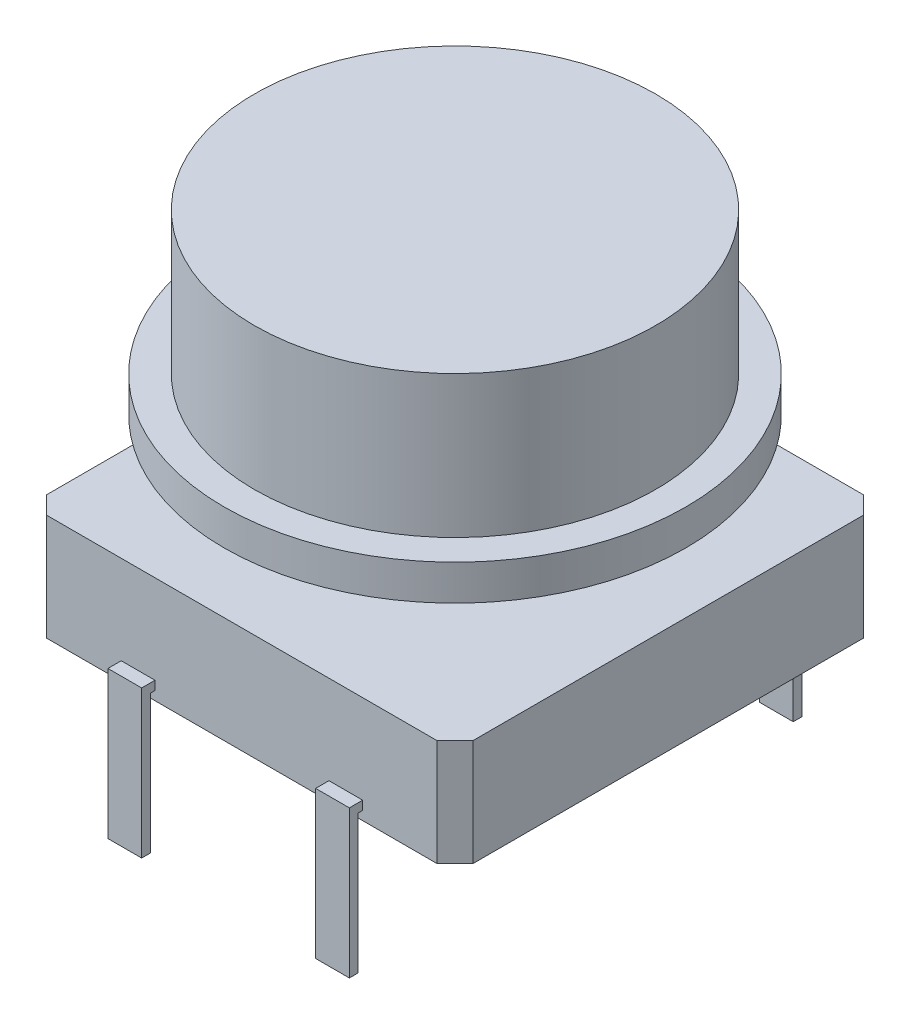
ISO-10303-21;
HEADER;
FILE_DESCRIPTION(('STEP AP214'),'2;1');
FILE_NAME('part.step','',(''),(''),'','','');
FILE_SCHEMA(('AUTOMOTIVE_DESIGN { 1 0 10303 214 1 1 1 1 }'));
ENDSEC;
DATA;
#1=APPLICATION_CONTEXT('core data for automotive mechanical design processes');
#2=APPLICATION_PROTOCOL_DEFINITION('international standard','automotive_design',2000,#1);
#3=PRODUCT_CONTEXT('',#1,'mechanical');
#4=PRODUCT('Part','Part','',(#3));
#5=PRODUCT_RELATED_PRODUCT_CATEGORY('part','',(#4));
#6=PRODUCT_DEFINITION_FORMATION('','',#4);
#7=PRODUCT_DEFINITION_CONTEXT('part definition',#1,'design');
#8=PRODUCT_DEFINITION('design','',#6,#7);
#9=PRODUCT_DEFINITION_SHAPE('','',#8);
#10=(LENGTH_UNIT() NAMED_UNIT(*) SI_UNIT(.MILLI.,.METRE.));
#11=(NAMED_UNIT(*) PLANE_ANGLE_UNIT() SI_UNIT($,.RADIAN.));
#12=(NAMED_UNIT(*) SI_UNIT($,.STERADIAN.) SOLID_ANGLE_UNIT());
#13=UNCERTAINTY_MEASURE_WITH_UNIT(LENGTH_MEASURE(1.E-05),#10,'distance_accuracy_value','');
#14=(GEOMETRIC_REPRESENTATION_CONTEXT(3) GLOBAL_UNCERTAINTY_ASSIGNED_CONTEXT((#13)) GLOBAL_UNIT_ASSIGNED_CONTEXT((#10,
#11,#12)) REPRESENTATION_CONTEXT('',''));
#15=CARTESIAN_POINT('',(0.,0.,0.));
#16=DIRECTION('',(0.,0.,1.));
#17=DIRECTION('',(1.,0.,0.));
#18=AXIS2_PLACEMENT_3D('',#15,#16,#17);
#19=CARTESIAN_POINT('',(-5.5,3.,-6.));
#20=DIRECTION('',(0.,0.,1.));
#21=DIRECTION('',(1.,0.,0.));
#22=AXIS2_PLACEMENT_3D('',#19,#20,#21);
#23=PLANE('',#22);
#24=DIRECTION('',(0.,-1.,0.));
#25=VECTOR('',#24,1.);
#26=CARTESIAN_POINT('',(-2.45,0.5,-6.));
#27=LINE('',#26,#25);
#28=CARTESIAN_POINT('',(-2.45,0.5,-6.));
#29=VERTEX_POINT('',#28);
#30=CARTESIAN_POINT('',(-2.45,0.25,-6.));
#31=VERTEX_POINT('',#30);
#32=EDGE_CURVE('E337',#29,#31,#27,.T.);
#33=ORIENTED_EDGE('',*,*,#32,.F.);
#34=DIRECTION('',(-1.,0.,0.));
#35=VECTOR('',#34,1.);
#36=CARTESIAN_POINT('',(-2.45,0.5,-6.));
#37=LINE('',#36,#35);
#38=CARTESIAN_POINT('',(-3.4,0.5,-6.));
#39=VERTEX_POINT('',#38);
#40=EDGE_CURVE('E362',#29,#39,#37,.T.);
#41=ORIENTED_EDGE('',*,*,#40,.T.);
#42=DIRECTION('',(0.,-1.,0.));
#43=VECTOR('',#42,1.);
#44=CARTESIAN_POINT('',(-3.4,0.5,-6.));
#45=LINE('',#44,#43);
#46=CARTESIAN_POINT('',(-3.4,0.25,-6.));
#47=VERTEX_POINT('',#46);
#48=EDGE_CURVE('E349',#39,#47,#45,.T.);
#49=ORIENTED_EDGE('',*,*,#48,.T.);
#50=DIRECTION('',(-1.,0.,0.));
#51=VECTOR('',#50,1.);
#52=CARTESIAN_POINT('',(-2.45,0.25,-6.));
#53=LINE('',#52,#51);
#54=EDGE_CURVE('E365',#31,#47,#53,.T.);
#55=ORIENTED_EDGE('',*,*,#54,.F.);
#56=EDGE_LOOP('',(#33,#41,#49,#55));
#57=FACE_BOUND('',#56,.T.);
#58=DIRECTION('',(-1.,0.,0.));
#59=VECTOR('',#58,1.);
#60=CARTESIAN_POINT('',(-5.5,0.,-6.));
#61=LINE('',#60,#59);
#62=CARTESIAN_POINT('',(5.5,0.,-6.));
#63=VERTEX_POINT('',#62);
#64=CARTESIAN_POINT('',(-5.5,0.,-6.));
#65=VERTEX_POINT('',#64);
#66=EDGE_CURVE('E547',#63,#65,#61,.T.);
#67=ORIENTED_EDGE('',*,*,#66,.T.);
#68=DIRECTION('',(0.,-1.,0.));
#69=VECTOR('',#68,1.);
#70=CARTESIAN_POINT('',(-5.5,3.,-6.));
#71=LINE('',#70,#69);
#72=CARTESIAN_POINT('',(-5.5,3.,-6.));
#73=VERTEX_POINT('',#72);
#74=EDGE_CURVE('E552',#73,#65,#71,.T.);
#75=ORIENTED_EDGE('',*,*,#74,.F.);
#76=DIRECTION('',(-1.,0.,0.));
#77=VECTOR('',#76,1.);
#78=CARTESIAN_POINT('',(-5.5,3.,-6.));
#79=LINE('',#78,#77);
#80=CARTESIAN_POINT('',(5.5,3.,-6.));
#81=VERTEX_POINT('',#80);
#82=EDGE_CURVE('E530',#81,#73,#79,.T.);
#83=ORIENTED_EDGE('',*,*,#82,.F.);
#84=DIRECTION('',(0.,-1.,0.));
#85=VECTOR('',#84,1.);
#86=CARTESIAN_POINT('',(5.5,3.,-6.));
#87=LINE('',#86,#85);
#88=EDGE_CURVE('E555',#81,#63,#87,.T.);
#89=ORIENTED_EDGE('',*,*,#88,.T.);
#90=EDGE_LOOP('',(#67,#75,#83,#89));
#91=FACE_BOUND('',#90,.T.);
#92=DIRECTION('',(0.,-1.,0.));
#93=VECTOR('',#92,1.);
#94=CARTESIAN_POINT('',(2.45,0.5,-6.));
#95=LINE('',#94,#93);
#96=CARTESIAN_POINT('',(2.45,0.5,-6.));
#97=VERTEX_POINT('',#96);
#98=CARTESIAN_POINT('',(2.45,0.25,-6.));
#99=VERTEX_POINT('',#98);
#100=EDGE_CURVE('E304',#97,#99,#95,.T.);
#101=ORIENTED_EDGE('',*,*,#100,.T.);
#102=DIRECTION('',(1.,0.,0.));
#103=VECTOR('',#102,1.);
#104=CARTESIAN_POINT('',(2.45,0.25,-6.));
#105=LINE('',#104,#103);
#106=CARTESIAN_POINT('',(3.4,0.25,-6.));
#107=VERTEX_POINT('',#106);
#108=EDGE_CURVE('E323',#99,#107,#105,.T.);
#109=ORIENTED_EDGE('',*,*,#108,.T.);
#110=DIRECTION('',(0.,-1.,0.));
#111=VECTOR('',#110,1.);
#112=CARTESIAN_POINT('',(3.4,0.5,-6.));
#113=LINE('',#112,#111);
#114=CARTESIAN_POINT('',(3.4,0.5,-6.));
#115=VERTEX_POINT('',#114);
#116=EDGE_CURVE('E315',#115,#107,#113,.T.);
#117=ORIENTED_EDGE('',*,*,#116,.F.);
#118=DIRECTION('',(1.,0.,0.));
#119=VECTOR('',#118,1.);
#120=CARTESIAN_POINT('',(2.45,0.5,-6.));
#121=LINE('',#120,#119);
#122=EDGE_CURVE('E326',#97,#115,#121,.T.);
#123=ORIENTED_EDGE('',*,*,#122,.F.);
#124=EDGE_LOOP('',(#101,#109,#117,#123));
#125=FACE_BOUND('',#124,.T.);
#126=ADVANCED_FACE('F35',(#57,#91,#125),#23,.F.);
#127=CARTESIAN_POINT('',(-5.5,3.,6.));
#128=DIRECTION('',(0.,0.,-1.));
#129=DIRECTION('',(-1.,0.,0.));
#130=AXIS2_PLACEMENT_3D('',#127,#128,#129);
#131=PLANE('',#130);
#132=DIRECTION('',(0.,-1.,0.));
#133=VECTOR('',#132,1.);
#134=CARTESIAN_POINT('',(-2.45,0.5,6.));
#135=LINE('',#134,#133);
#136=CARTESIAN_POINT('',(-2.45,0.5,6.));
#137=VERTEX_POINT('',#136);
#138=CARTESIAN_POINT('',(-2.45,0.25,6.));
#139=VERTEX_POINT('',#138);
#140=EDGE_CURVE('E427',#137,#139,#135,.T.);
#141=ORIENTED_EDGE('',*,*,#140,.T.);
#142=DIRECTION('',(-1.,0.,0.));
#143=VECTOR('',#142,1.);
#144=CARTESIAN_POINT('',(-2.45,0.25,6.));
#145=LINE('',#144,#143);
#146=CARTESIAN_POINT('',(-3.4,0.25,6.));
#147=VERTEX_POINT('',#146);
#148=EDGE_CURVE('E457',#139,#147,#145,.T.);
#149=ORIENTED_EDGE('',*,*,#148,.T.);
#150=DIRECTION('',(0.,-1.,0.));
#151=VECTOR('',#150,1.);
#152=CARTESIAN_POINT('',(-3.4,0.5,6.));
#153=LINE('',#152,#151);
#154=CARTESIAN_POINT('',(-3.4,0.5,6.));
#155=VERTEX_POINT('',#154);
#156=EDGE_CURVE('E444',#155,#147,#153,.T.);
#157=ORIENTED_EDGE('',*,*,#156,.F.);
#158=DIRECTION('',(-1.,0.,0.));
#159=VECTOR('',#158,1.);
#160=CARTESIAN_POINT('',(-2.45,0.5,6.));
#161=LINE('',#160,#159);
#162=EDGE_CURVE('E460',#137,#155,#161,.T.);
#163=ORIENTED_EDGE('',*,*,#162,.F.);
#164=EDGE_LOOP('',(#141,#149,#157,#163));
#165=FACE_BOUND('',#164,.T.);
#166=DIRECTION('',(1.,0.,0.));
#167=VECTOR('',#166,1.);
#168=CARTESIAN_POINT('',(-5.5,0.,6.));
#169=LINE('',#168,#167);
#170=CARTESIAN_POINT('',(-5.5,0.,6.));
#171=VERTEX_POINT('',#170);
#172=CARTESIAN_POINT('',(5.5,0.,6.));
#173=VERTEX_POINT('',#172);
#174=EDGE_CURVE('E539',#171,#173,#169,.T.);
#175=ORIENTED_EDGE('',*,*,#174,.T.);
#176=DIRECTION('',(0.,-1.,0.));
#177=VECTOR('',#176,1.);
#178=CARTESIAN_POINT('',(5.5,3.,6.));
#179=LINE('',#178,#177);
#180=CARTESIAN_POINT('',(5.5,3.,6.));
#181=VERTEX_POINT('',#180);
#182=EDGE_CURVE('E564',#181,#173,#179,.T.);
#183=ORIENTED_EDGE('',*,*,#182,.F.);
#184=DIRECTION('',(1.,0.,0.));
#185=VECTOR('',#184,1.);
#186=CARTESIAN_POINT('',(-5.5,3.,6.));
#187=LINE('',#186,#185);
#188=CARTESIAN_POINT('',(-5.5,3.,6.));
#189=VERTEX_POINT('',#188);
#190=EDGE_CURVE('E522',#189,#181,#187,.T.);
#191=ORIENTED_EDGE('',*,*,#190,.F.);
#192=DIRECTION('',(0.,-1.,0.));
#193=VECTOR('',#192,1.);
#194=CARTESIAN_POINT('',(-5.5,3.,6.));
#195=LINE('',#194,#193);
#196=EDGE_CURVE('E566',#189,#171,#195,.T.);
#197=ORIENTED_EDGE('',*,*,#196,.T.);
#198=EDGE_LOOP('',(#175,#183,#191,#197));
#199=FACE_BOUND('',#198,.T.);
#200=DIRECTION('',(0.,-1.,0.));
#201=VECTOR('',#200,1.);
#202=CARTESIAN_POINT('',(2.45,0.5,6.));
#203=LINE('',#202,#201);
#204=CARTESIAN_POINT('',(2.45,0.5,6.));
#205=VERTEX_POINT('',#204);
#206=CARTESIAN_POINT('',(2.45,0.25,6.));
#207=VERTEX_POINT('',#206);
#208=EDGE_CURVE('E380',#205,#207,#203,.T.);
#209=ORIENTED_EDGE('',*,*,#208,.F.);
#210=DIRECTION('',(1.,0.,0.));
#211=VECTOR('',#210,1.);
#212=CARTESIAN_POINT('',(2.45,0.5,6.));
#213=LINE('',#212,#211);
#214=CARTESIAN_POINT('',(3.4,0.5,6.));
#215=VERTEX_POINT('',#214);
#216=EDGE_CURVE('E406',#205,#215,#213,.T.);
#217=ORIENTED_EDGE('',*,*,#216,.T.);
#218=DIRECTION('',(0.,-1.,0.));
#219=VECTOR('',#218,1.);
#220=CARTESIAN_POINT('',(3.4,0.5,6.));
#221=LINE('',#220,#219);
#222=CARTESIAN_POINT('',(3.4,0.25,6.));
#223=VERTEX_POINT('',#222);
#224=EDGE_CURVE('E393',#215,#223,#221,.T.);
#225=ORIENTED_EDGE('',*,*,#224,.T.);
#226=DIRECTION('',(1.,0.,0.));
#227=VECTOR('',#226,1.);
#228=CARTESIAN_POINT('',(2.45,0.25,6.));
#229=LINE('',#228,#227);
#230=EDGE_CURVE('E409',#207,#223,#229,.T.);
#231=ORIENTED_EDGE('',*,*,#230,.F.);
#232=EDGE_LOOP('',(#209,#217,#225,#231));
#233=FACE_BOUND('',#232,.T.);
#234=ADVANCED_FACE('F587',(#165,#199,#233),#131,.F.);
#235=CARTESIAN_POINT('',(-6.,3.,-5.5));
#236=DIRECTION('',(1.,0.,0.));
#237=DIRECTION('',(0.,0.,-1.));
#238=AXIS2_PLACEMENT_3D('',#235,#236,#237);
#239=PLANE('',#238);
#240=DIRECTION('',(0.,0.,1.));
#241=VECTOR('',#240,1.);
#242=CARTESIAN_POINT('',(-6.,0.,-5.5));
#243=LINE('',#242,#241);
#244=CARTESIAN_POINT('',(-6.,0.,-5.5));
#245=VERTEX_POINT('',#244);
#246=CARTESIAN_POINT('',(-6.,0.,5.5));
#247=VERTEX_POINT('',#246);
#248=EDGE_CURVE('E513',#245,#247,#243,.T.);
#249=ORIENTED_EDGE('',*,*,#248,.T.);
#250=DIRECTION('',(0.,-1.,0.));
#251=VECTOR('',#250,1.);
#252=CARTESIAN_POINT('',(-6.,3.,5.5));
#253=LINE('',#252,#251);
#254=CARTESIAN_POINT('',(-6.,3.,5.5));
#255=VERTEX_POINT('',#254);
#256=EDGE_CURVE('E39',#255,#247,#253,.T.);
#257=ORIENTED_EDGE('',*,*,#256,.F.);
#258=DIRECTION('',(0.,0.,1.));
#259=VECTOR('',#258,1.);
#260=CARTESIAN_POINT('',(-6.,3.,-5.5));
#261=LINE('',#260,#259);
#262=CARTESIAN_POINT('',(-6.,3.,-5.5));
#263=VERTEX_POINT('',#262);
#264=EDGE_CURVE('E516',#263,#255,#261,.T.);
#265=ORIENTED_EDGE('',*,*,#264,.F.);
#266=DIRECTION('',(0.,-1.,0.));
#267=VECTOR('',#266,1.);
#268=CARTESIAN_POINT('',(-6.,3.,-5.5));
#269=LINE('',#268,#267);
#270=EDGE_CURVE('E534',#263,#245,#269,.T.);
#271=ORIENTED_EDGE('',*,*,#270,.T.);
#272=EDGE_LOOP('',(#249,#257,#265,#271));
#273=FACE_BOUND('',#272,.T.);
#274=ADVANCED_FACE('F37',(#273),#239,.F.);
#275=CARTESIAN_POINT('',(-6.,3.,5.5));
#276=DIRECTION('',(0.707106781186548,0.,-0.707106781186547));
#277=DIRECTION('',(-0.707106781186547,0.,-0.707106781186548));
#278=AXIS2_PLACEMENT_3D('',#275,#276,#277);
#279=PLANE('',#278);
#280=DIRECTION('',(0.707106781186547,0.,0.707106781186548));
#281=VECTOR('',#280,1.);
#282=CARTESIAN_POINT('',(-6.,0.,5.5));
#283=LINE('',#282,#281);
#284=EDGE_CURVE('E537',#247,#171,#283,.T.);
#285=ORIENTED_EDGE('',*,*,#284,.T.);
#286=ORIENTED_EDGE('',*,*,#196,.F.);
#287=DIRECTION('',(0.707106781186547,0.,0.707106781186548));
#288=VECTOR('',#287,1.);
#289=CARTESIAN_POINT('',(-6.,3.,5.5));
#290=LINE('',#289,#288);
#291=EDGE_CURVE('E519',#255,#189,#290,.T.);
#292=ORIENTED_EDGE('',*,*,#291,.F.);
#293=ORIENTED_EDGE('',*,*,#256,.T.);
#294=EDGE_LOOP('',(#285,#286,#292,#293));
#295=FACE_BOUND('',#294,.T.);
#296=ADVANCED_FACE('F575',(#295),#279,.F.);
#297=CARTESIAN_POINT('',(5.5,3.,6.));
#298=DIRECTION('',(-0.707106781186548,0.,-0.707106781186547));
#299=DIRECTION('',(-0.707106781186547,0.,0.707106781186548));
#300=AXIS2_PLACEMENT_3D('',#297,#298,#299);
#301=PLANE('',#300);
#302=DIRECTION('',(0.707106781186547,0.,-0.707106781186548));
#303=VECTOR('',#302,1.);
#304=CARTESIAN_POINT('',(5.5,0.,6.));
#305=LINE('',#304,#303);
#306=CARTESIAN_POINT('',(6.,0.,5.5));
#307=VERTEX_POINT('',#306);
#308=EDGE_CURVE('E541',#173,#307,#305,.T.);
#309=ORIENTED_EDGE('',*,*,#308,.T.);
#310=DIRECTION('',(0.,-1.,0.));
#311=VECTOR('',#310,1.);
#312=CARTESIAN_POINT('',(6.,3.,5.5));
#313=LINE('',#312,#311);
#314=CARTESIAN_POINT('',(6.,3.,5.5));
#315=VERTEX_POINT('',#314);
#316=EDGE_CURVE('E561',#315,#307,#313,.T.);
#317=ORIENTED_EDGE('',*,*,#316,.F.);
#318=DIRECTION('',(0.707106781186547,0.,-0.707106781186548));
#319=VECTOR('',#318,1.);
#320=CARTESIAN_POINT('',(5.5,3.,6.));
#321=LINE('',#320,#319);
#322=EDGE_CURVE('E524',#181,#315,#321,.T.);
#323=ORIENTED_EDGE('',*,*,#322,.F.);
#324=ORIENTED_EDGE('',*,*,#182,.T.);
#325=EDGE_LOOP('',(#309,#317,#323,#324));
#326=FACE_BOUND('',#325,.T.);
#327=ADVANCED_FACE('F591',(#326),#301,.F.);
#328=CARTESIAN_POINT('',(6.,3.,-5.5));
#329=DIRECTION('',(-1.,0.,0.));
#330=DIRECTION('',(0.,0.,1.));
#331=AXIS2_PLACEMENT_3D('',#328,#329,#330);
#332=PLANE('',#331);
#333=DIRECTION('',(0.,0.,-1.));
#334=VECTOR('',#333,1.);
#335=CARTESIAN_POINT('',(6.,0.,-5.5));
#336=LINE('',#335,#334);
#337=CARTESIAN_POINT('',(6.,0.,-5.5));
#338=VERTEX_POINT('',#337);
#339=EDGE_CURVE('E543',#307,#338,#336,.T.);
#340=ORIENTED_EDGE('',*,*,#339,.T.);
#341=DIRECTION('',(0.,-1.,0.));
#342=VECTOR('',#341,1.);
#343=CARTESIAN_POINT('',(6.,3.,-5.5));
#344=LINE('',#343,#342);
#345=CARTESIAN_POINT('',(6.,3.,-5.5));
#346=VERTEX_POINT('',#345);
#347=EDGE_CURVE('E558',#346,#338,#344,.T.);
#348=ORIENTED_EDGE('',*,*,#347,.F.);
#349=DIRECTION('',(0.,0.,-1.));
#350=VECTOR('',#349,1.);
#351=CARTESIAN_POINT('',(6.,3.,-5.5));
#352=LINE('',#351,#350);
#353=EDGE_CURVE('E526',#315,#346,#352,.T.);
#354=ORIENTED_EDGE('',*,*,#353,.F.);
#355=ORIENTED_EDGE('',*,*,#316,.T.);
#356=EDGE_LOOP('',(#340,#348,#354,#355));
#357=FACE_BOUND('',#356,.T.);
#358=ADVANCED_FACE('F610',(#357),#332,.F.);
#359=CARTESIAN_POINT('',(5.5,3.,-6.));
#360=DIRECTION('',(-0.707106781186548,0.,0.707106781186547));
#361=DIRECTION('',(0.707106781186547,0.,0.707106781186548));
#362=AXIS2_PLACEMENT_3D('',#359,#360,#361);
#363=PLANE('',#362);
#364=DIRECTION('',(-0.707106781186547,0.,-0.707106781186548));
#365=VECTOR('',#364,1.);
#366=CARTESIAN_POINT('',(5.5,0.,-6.));
#367=LINE('',#366,#365);
#368=EDGE_CURVE('E545',#338,#63,#367,.T.);
#369=ORIENTED_EDGE('',*,*,#368,.T.);
#370=ORIENTED_EDGE('',*,*,#88,.F.);
#371=DIRECTION('',(-0.707106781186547,0.,-0.707106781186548));
#372=VECTOR('',#371,1.);
#373=CARTESIAN_POINT('',(5.5,3.,-6.));
#374=LINE('',#373,#372);
#375=EDGE_CURVE('E528',#346,#81,#374,.T.);
#376=ORIENTED_EDGE('',*,*,#375,.F.);
#377=ORIENTED_EDGE('',*,*,#347,.T.);
#378=EDGE_LOOP('',(#369,#370,#376,#377));
#379=FACE_BOUND('',#378,.T.);
#380=ADVANCED_FACE('F607',(#379),#363,.F.);
#381=CARTESIAN_POINT('',(-5.5,3.,-6.));
#382=DIRECTION('',(0.707106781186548,0.,0.707106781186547));
#383=DIRECTION('',(0.707106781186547,0.,-0.707106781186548));
#384=AXIS2_PLACEMENT_3D('',#381,#382,#383);
#385=PLANE('',#384);
#386=DIRECTION('',(-0.707106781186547,0.,0.707106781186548));
#387=VECTOR('',#386,1.);
#388=CARTESIAN_POINT('',(-5.5,0.,-6.));
#389=LINE('',#388,#387);
#390=EDGE_CURVE('E520',#65,#245,#389,.T.);
#391=ORIENTED_EDGE('',*,*,#390,.T.);
#392=ORIENTED_EDGE('',*,*,#270,.F.);
#393=DIRECTION('',(-0.707106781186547,0.,0.707106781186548));
#394=VECTOR('',#393,1.);
#395=CARTESIAN_POINT('',(-5.5,3.,-6.));
#396=LINE('',#395,#394);
#397=EDGE_CURVE('E532',#73,#263,#396,.T.);
#398=ORIENTED_EDGE('',*,*,#397,.F.);
#399=ORIENTED_EDGE('',*,*,#74,.T.);
#400=EDGE_LOOP('',(#391,#392,#398,#399));
#401=FACE_BOUND('',#400,.T.);
#402=ADVANCED_FACE('F601',(#401),#385,.F.);
#403=CARTESIAN_POINT('',(0.,3.,0.));
#404=DIRECTION('',(0.,1.,0.));
#405=DIRECTION('',(0.,0.,1.));
#406=AXIS2_PLACEMENT_3D('',#403,#404,#405);
#407=PLANE('',#406);
#408=CARTESIAN_POINT('',(0.,3.,0.));
#409=DIRECTION('',(0.,1.,0.));
#410=DIRECTION('',(0.,0.,1.));
#411=AXIS2_PLACEMENT_3D('',#408,#409,#410);
#412=CIRCLE('',#411,3.375);
#413=CARTESIAN_POINT('',(0.,3.,3.375));
#414=VERTEX_POINT('',#413);
#415=EDGE_CURVE('E44',#414,#414,#412,.T.);
#416=ORIENTED_EDGE('',*,*,#415,.F.);
#417=EDGE_LOOP('',(#416));
#418=FACE_BOUND('',#417,.T.);
#419=ORIENTED_EDGE('',*,*,#264,.T.);
#420=ORIENTED_EDGE('',*,*,#291,.T.);
#421=ORIENTED_EDGE('',*,*,#190,.T.);
#422=ORIENTED_EDGE('',*,*,#322,.T.);
#423=ORIENTED_EDGE('',*,*,#353,.T.);
#424=ORIENTED_EDGE('',*,*,#375,.T.);
#425=ORIENTED_EDGE('',*,*,#82,.T.);
#426=ORIENTED_EDGE('',*,*,#397,.T.);
#427=EDGE_LOOP('',(#419,#420,#421,#422,#423,#424,#425,#426));
#428=FACE_BOUND('',#427,.T.);
#429=ADVANCED_FACE('F595',(#418,#428),#407,.T.);
#430=CARTESIAN_POINT('',(0.,0.,0.));
#431=DIRECTION('',(0.,1.,0.));
#432=DIRECTION('',(0.,0.,1.));
#433=AXIS2_PLACEMENT_3D('',#430,#431,#432);
#434=PLANE('',#433);
#435=ORIENTED_EDGE('',*,*,#248,.F.);
#436=ORIENTED_EDGE('',*,*,#390,.F.);
#437=ORIENTED_EDGE('',*,*,#66,.F.);
#438=ORIENTED_EDGE('',*,*,#368,.F.);
#439=ORIENTED_EDGE('',*,*,#339,.F.);
#440=ORIENTED_EDGE('',*,*,#308,.F.);
#441=ORIENTED_EDGE('',*,*,#174,.F.);
#442=ORIENTED_EDGE('',*,*,#284,.F.);
#443=EDGE_LOOP('',(#435,#436,#437,#438,#439,#440,#441,#442));
#444=FACE_BOUND('',#443,.T.);
#445=ADVANCED_FACE('F582',(#444),#434,.F.);
#446=CARTESIAN_POINT('',(0.,3.2,0.));
#447=DIRECTION('',(0.,-1.,0.));
#448=DIRECTION('',(0.,0.,-1.));
#449=AXIS2_PLACEMENT_3D('',#446,#447,#448);
#450=CYLINDRICAL_SURFACE('',#449,3.375);
#451=CARTESIAN_POINT('',(0.,3.2,0.));
#452=DIRECTION('',(0.,1.,0.));
#453=DIRECTION('',(0.,0.,1.));
#454=AXIS2_PLACEMENT_3D('',#451,#452,#453);
#455=CIRCLE('',#454,3.375);
#456=CARTESIAN_POINT('',(0.,3.2,3.375));
#457=VERTEX_POINT('',#456);
#458=EDGE_CURVE('E510',#457,#457,#455,.T.);
#459=ORIENTED_EDGE('',*,*,#458,.F.);
#460=EDGE_LOOP('',(#459));
#461=FACE_BOUND('',#460,.T.);
#462=ORIENTED_EDGE('',*,*,#415,.T.);
#463=EDGE_LOOP('',(#462));
#464=FACE_BOUND('',#463,.T.);
#465=ADVANCED_FACE('F633',(#461,#464),#450,.T.);
#466=CARTESIAN_POINT('',(0.,3.2,0.));
#467=DIRECTION('',(0.,1.,0.));
#468=DIRECTION('',(0.,0.,1.));
#469=AXIS2_PLACEMENT_3D('',#466,#467,#468);
#470=PLANE('',#469);
#471=DIRECTION('',(0.,0.,-1.));
#472=VECTOR('',#471,1.);
#473=CARTESIAN_POINT('',(1.75,3.2,-1.75));
#474=LINE('',#473,#472);
#475=CARTESIAN_POINT('',(1.75,3.2,1.75));
#476=VERTEX_POINT('',#475);
#477=CARTESIAN_POINT('',(1.75,3.2,-1.75));
#478=VERTEX_POINT('',#477);
#479=EDGE_CURVE('E472',#476,#478,#474,.T.);
#480=ORIENTED_EDGE('',*,*,#479,.F.);
#481=DIRECTION('',(1.,0.,0.));
#482=VECTOR('',#481,1.);
#483=CARTESIAN_POINT('',(-1.75,3.2,1.75));
#484=LINE('',#483,#482);
#485=CARTESIAN_POINT('',(-1.75,3.2,1.75));
#486=VERTEX_POINT('',#485);
#487=EDGE_CURVE('E479',#486,#476,#484,.T.);
#488=ORIENTED_EDGE('',*,*,#487,.F.);
#489=DIRECTION('',(0.,0.,1.));
#490=VECTOR('',#489,1.);
#491=CARTESIAN_POINT('',(-1.75,3.2,-1.75));
#492=LINE('',#491,#490);
#493=CARTESIAN_POINT('',(-1.75,3.2,-1.75));
#494=VERTEX_POINT('',#493);
#495=EDGE_CURVE('E494',#494,#486,#492,.T.);
#496=ORIENTED_EDGE('',*,*,#495,.F.);
#497=DIRECTION('',(-1.,0.,0.));
#498=VECTOR('',#497,1.);
#499=CARTESIAN_POINT('',(-1.75,3.2,-1.75));
#500=LINE('',#499,#498);
#501=EDGE_CURVE('E491',#478,#494,#500,.T.);
#502=ORIENTED_EDGE('',*,*,#501,.F.);
#503=EDGE_LOOP('',(#480,#488,#496,#502));
#504=FACE_BOUND('',#503,.T.);
#505=ORIENTED_EDGE('',*,*,#458,.T.);
#506=EDGE_LOOP('',(#505));
#507=FACE_BOUND('',#506,.T.);
#508=ADVANCED_FACE('F639',(#504,#507),#470,.T.);
#509=CARTESIAN_POINT('',(1.75,5.2,-1.75));
#510=DIRECTION('',(-1.,0.,0.));
#511=DIRECTION('',(0.,0.,1.));
#512=AXIS2_PLACEMENT_3D('',#509,#510,#511);
#513=PLANE('',#512);
#514=ORIENTED_EDGE('',*,*,#479,.T.);
#515=DIRECTION('',(0.,-1.,0.));
#516=VECTOR('',#515,1.);
#517=CARTESIAN_POINT('',(1.75,5.2,-1.75));
#518=LINE('',#517,#516);
#519=CARTESIAN_POINT('',(1.75,5.2,-1.75));
#520=VERTEX_POINT('',#519);
#521=EDGE_CURVE('E507',#520,#478,#518,.T.);
#522=ORIENTED_EDGE('',*,*,#521,.F.);
#523=DIRECTION('',(0.,0.,-1.));
#524=VECTOR('',#523,1.);
#525=CARTESIAN_POINT('',(1.75,5.2,-1.75));
#526=LINE('',#525,#524);
#527=CARTESIAN_POINT('',(1.75,5.2,1.75));
#528=VERTEX_POINT('',#527);
#529=EDGE_CURVE('E475',#528,#520,#526,.T.);
#530=ORIENTED_EDGE('',*,*,#529,.F.);
#531=DIRECTION('',(0.,-1.,0.));
#532=VECTOR('',#531,1.);
#533=CARTESIAN_POINT('',(1.75,5.2,1.75));
#534=LINE('',#533,#532);
#535=EDGE_CURVE('E488',#528,#476,#534,.T.);
#536=ORIENTED_EDGE('',*,*,#535,.T.);
#537=EDGE_LOOP('',(#514,#522,#530,#536));
#538=FACE_BOUND('',#537,.T.);
#539=ADVANCED_FACE('F643',(#538),#513,.F.);
#540=CARTESIAN_POINT('',(-1.75,5.2,-1.75));
#541=DIRECTION('',(0.,0.,1.));
#542=DIRECTION('',(1.,0.,0.));
#543=AXIS2_PLACEMENT_3D('',#540,#541,#542);
#544=PLANE('',#543);
#545=ORIENTED_EDGE('',*,*,#501,.T.);
#546=DIRECTION('',(0.,-1.,0.));
#547=VECTOR('',#546,1.);
#548=CARTESIAN_POINT('',(-1.75,5.2,-1.75));
#549=LINE('',#548,#547);
#550=CARTESIAN_POINT('',(-1.75,5.2,-1.75));
#551=VERTEX_POINT('',#550);
#552=EDGE_CURVE('E504',#551,#494,#549,.T.);
#553=ORIENTED_EDGE('',*,*,#552,.F.);
#554=DIRECTION('',(-1.,0.,0.));
#555=VECTOR('',#554,1.);
#556=CARTESIAN_POINT('',(-1.75,5.2,-1.75));
#557=LINE('',#556,#555);
#558=EDGE_CURVE('E478',#520,#551,#557,.T.);
#559=ORIENTED_EDGE('',*,*,#558,.F.);
#560=ORIENTED_EDGE('',*,*,#521,.T.);
#561=EDGE_LOOP('',(#545,#553,#559,#560));
#562=FACE_BOUND('',#561,.T.);
#563=ADVANCED_FACE('F647',(#562),#544,.F.);
#564=CARTESIAN_POINT('',(-1.75,5.2,-1.75));
#565=DIRECTION('',(1.,0.,0.));
#566=DIRECTION('',(0.,0.,-1.));
#567=AXIS2_PLACEMENT_3D('',#564,#565,#566);
#568=PLANE('',#567);
#569=ORIENTED_EDGE('',*,*,#495,.T.);
#570=DIRECTION('',(0.,-1.,0.));
#571=VECTOR('',#570,1.);
#572=CARTESIAN_POINT('',(-1.75,5.2,1.75));
#573=LINE('',#572,#571);
#574=CARTESIAN_POINT('',(-1.75,5.2,1.75));
#575=VERTEX_POINT('',#574);
#576=EDGE_CURVE('E501',#575,#486,#573,.T.);
#577=ORIENTED_EDGE('',*,*,#576,.F.);
#578=DIRECTION('',(0.,0.,1.));
#579=VECTOR('',#578,1.);
#580=CARTESIAN_POINT('',(-1.75,5.2,-1.75));
#581=LINE('',#580,#579);
#582=EDGE_CURVE('E482',#551,#575,#581,.T.);
#583=ORIENTED_EDGE('',*,*,#582,.F.);
#584=ORIENTED_EDGE('',*,*,#552,.T.);
#585=EDGE_LOOP('',(#569,#577,#583,#584));
#586=FACE_BOUND('',#585,.T.);
#587=ADVANCED_FACE('F651',(#586),#568,.F.);
#588=CARTESIAN_POINT('',(-1.75,5.2,1.75));
#589=DIRECTION('',(0.,0.,-1.));
#590=DIRECTION('',(-1.,0.,0.));
#591=AXIS2_PLACEMENT_3D('',#588,#589,#590);
#592=PLANE('',#591);
#593=ORIENTED_EDGE('',*,*,#487,.T.);
#594=ORIENTED_EDGE('',*,*,#535,.F.);
#595=DIRECTION('',(1.,0.,0.));
#596=VECTOR('',#595,1.);
#597=CARTESIAN_POINT('',(-1.75,5.2,1.75));
#598=LINE('',#597,#596);
#599=EDGE_CURVE('E485',#575,#528,#598,.T.);
#600=ORIENTED_EDGE('',*,*,#599,.F.);
#601=ORIENTED_EDGE('',*,*,#576,.T.);
#602=EDGE_LOOP('',(#593,#594,#600,#601));
#603=FACE_BOUND('',#602,.T.);
#604=ADVANCED_FACE('F655',(#603),#592,.F.);
#605=CARTESIAN_POINT('',(0.,5.2,0.));
#606=DIRECTION('',(0.,1.,0.));
#607=DIRECTION('',(0.,0.,1.));
#608=AXIS2_PLACEMENT_3D('',#605,#606,#607);
#609=PLANE('',#608);
#610=CARTESIAN_POINT('',(0.,5.2,0.));
#611=DIRECTION('',(0.,1.,0.));
#612=DIRECTION('',(0.,0.,1.));
#613=AXIS2_PLACEMENT_3D('',#610,#611,#612);
#614=CIRCLE('',#613,6.5);
#615=CARTESIAN_POINT('',(0.,5.2,6.5));
#616=VERTEX_POINT('',#615);
#617=EDGE_CURVE('E467',#616,#616,#614,.T.);
#618=ORIENTED_EDGE('',*,*,#617,.F.);
#619=EDGE_LOOP('',(#618));
#620=FACE_BOUND('',#619,.T.);
#621=ORIENTED_EDGE('',*,*,#599,.T.);
#622=ORIENTED_EDGE('',*,*,#529,.T.);
#623=ORIENTED_EDGE('',*,*,#558,.T.);
#624=ORIENTED_EDGE('',*,*,#582,.T.);
#625=EDGE_LOOP('',(#621,#622,#623,#624));
#626=FACE_BOUND('',#625,.T.);
#627=ADVANCED_FACE('F659',(#620,#626),#609,.F.);
#628=CARTESIAN_POINT('',(0.,6.2,0.));
#629=DIRECTION('',(0.,-1.,0.));
#630=DIRECTION('',(0.,0.,-1.));
#631=AXIS2_PLACEMENT_3D('',#628,#629,#630);
#632=CYLINDRICAL_SURFACE('',#631,6.5);
#633=CARTESIAN_POINT('',(0.,6.2,0.));
#634=DIRECTION('',(0.,1.,0.));
#635=DIRECTION('',(0.,0.,1.));
#636=AXIS2_PLACEMENT_3D('',#633,#634,#635);
#637=CIRCLE('',#636,6.5);
#638=CARTESIAN_POINT('',(0.,6.2,6.5));
#639=VERTEX_POINT('',#638);
#640=EDGE_CURVE('E469',#639,#639,#637,.T.);
#641=ORIENTED_EDGE('',*,*,#640,.F.);
#642=EDGE_LOOP('',(#641));
#643=FACE_BOUND('',#642,.T.);
#644=ORIENTED_EDGE('',*,*,#617,.T.);
#645=EDGE_LOOP('',(#644));
#646=FACE_BOUND('',#645,.T.);
#647=ADVANCED_FACE('F661',(#643,#646),#632,.T.);
#648=CARTESIAN_POINT('',(0.,6.2,0.));
#649=DIRECTION('',(0.,1.,0.));
#650=DIRECTION('',(0.,0.,1.));
#651=AXIS2_PLACEMENT_3D('',#648,#649,#650);
#652=PLANE('',#651);
#653=CARTESIAN_POINT('',(0.,6.2,0.));
#654=DIRECTION('',(0.,1.,0.));
#655=DIRECTION('',(0.,0.,1.));
#656=AXIS2_PLACEMENT_3D('',#653,#654,#655);
#657=CIRCLE('',#656,5.65);
#658=CARTESIAN_POINT('',(0.,6.2,5.65));
#659=VERTEX_POINT('',#658);
#660=EDGE_CURVE('E11',#659,#659,#657,.T.);
#661=ORIENTED_EDGE('',*,*,#660,.F.);
#662=EDGE_LOOP('',(#661));
#663=FACE_BOUND('',#662,.T.);
#664=ORIENTED_EDGE('',*,*,#640,.T.);
#665=EDGE_LOOP('',(#664));
#666=FACE_BOUND('',#665,.T.);
#667=ADVANCED_FACE('F664',(#663,#666),#652,.T.);
#668=CARTESIAN_POINT('',(0.,10.2,0.));
#669=DIRECTION('',(0.,-1.,0.));
#670=DIRECTION('',(0.,0.,-1.));
#671=AXIS2_PLACEMENT_3D('',#668,#669,#670);
#672=CYLINDRICAL_SURFACE('',#671,5.65);
#673=CARTESIAN_POINT('',(0.,10.2,0.));
#674=DIRECTION('',(0.,1.,0.));
#675=DIRECTION('',(0.,0.,1.));
#676=AXIS2_PLACEMENT_3D('',#673,#674,#675);
#677=CIRCLE('',#676,5.65);
#678=CARTESIAN_POINT('',(0.,10.2,5.65));
#679=VERTEX_POINT('',#678);
#680=EDGE_CURVE('E454',#679,#679,#677,.T.);
#681=ORIENTED_EDGE('',*,*,#680,.F.);
#682=EDGE_LOOP('',(#681));
#683=FACE_BOUND('',#682,.T.);
#684=ORIENTED_EDGE('',*,*,#660,.T.);
#685=EDGE_LOOP('',(#684));
#686=FACE_BOUND('',#685,.T.);
#687=ADVANCED_FACE('F671',(#683,#686),#672,.T.);
#688=CARTESIAN_POINT('',(0.,10.2,0.));
#689=DIRECTION('',(0.,1.,0.));
#690=DIRECTION('',(0.,0.,1.));
#691=AXIS2_PLACEMENT_3D('',#688,#689,#690);
#692=PLANE('',#691);
#693=ORIENTED_EDGE('',*,*,#680,.T.);
#694=EDGE_LOOP('',(#693));
#695=FACE_BOUND('',#694,.T.);
#696=ADVANCED_FACE('F675',(#695),#692,.T.);
#697=CARTESIAN_POINT('',(-2.45,-3.65,6.375));
#698=DIRECTION('',(0.,-1.,0.));
#699=DIRECTION('',(0.,0.,-1.));
#700=AXIS2_PLACEMENT_3D('',#697,#698,#699);
#701=PLANE('',#700);
#702=DIRECTION('',(0.,0.,1.));
#703=VECTOR('',#702,1.);
#704=CARTESIAN_POINT('',(-3.4,-3.65,6.375));
#705=LINE('',#704,#703);
#706=CARTESIAN_POINT('',(-3.4,-3.65,6.125));
#707=VERTEX_POINT('',#706);
#708=CARTESIAN_POINT('',(-3.4,-3.65,6.375));
#709=VERTEX_POINT('',#708);
#710=EDGE_CURVE('E402',#707,#709,#705,.T.);
#711=ORIENTED_EDGE('',*,*,#710,.F.);
#712=DIRECTION('',(-1.,0.,0.));
#713=VECTOR('',#712,1.);
#714=CARTESIAN_POINT('',(-2.45,-3.65,6.125));
#715=LINE('',#714,#713);
#716=CARTESIAN_POINT('',(-2.45,-3.65,6.125));
#717=VERTEX_POINT('',#716);
#718=EDGE_CURVE('E452',#717,#707,#715,.T.);
#719=ORIENTED_EDGE('',*,*,#718,.F.);
#720=DIRECTION('',(0.,0.,1.));
#721=VECTOR('',#720,1.);
#722=CARTESIAN_POINT('',(-2.45,-3.65,6.375));
#723=LINE('',#722,#721);
#724=CARTESIAN_POINT('',(-2.45,-3.65,6.375));
#725=VERTEX_POINT('',#724);
#726=EDGE_CURVE('E417',#717,#725,#723,.T.);
#727=ORIENTED_EDGE('',*,*,#726,.T.);
#728=DIRECTION('',(-1.,0.,0.));
#729=VECTOR('',#728,1.);
#730=CARTESIAN_POINT('',(-2.45,-3.65,6.375));
#731=LINE('',#730,#729);
#732=EDGE_CURVE('E436',#725,#709,#731,.T.);
#733=ORIENTED_EDGE('',*,*,#732,.T.);
#734=EDGE_LOOP('',(#711,#719,#727,#733));
#735=FACE_BOUND('',#734,.T.);
#736=ADVANCED_FACE('F679',(#735),#701,.T.);
#737=CARTESIAN_POINT('',(-2.45,0.25,6.125));
#738=DIRECTION('',(0.,0.,-1.));
#739=DIRECTION('',(-1.,0.,0.));
#740=AXIS2_PLACEMENT_3D('',#737,#738,#739);
#741=PLANE('',#740);
#742=DIRECTION('',(0.,-1.,0.));
#743=VECTOR('',#742,1.);
#744=CARTESIAN_POINT('',(-3.4,0.25,6.125));
#745=LINE('',#744,#743);
#746=CARTESIAN_POINT('',(-3.4,0.25,6.125));
#747=VERTEX_POINT('',#746);
#748=EDGE_CURVE('E421',#747,#707,#745,.T.);
#749=ORIENTED_EDGE('',*,*,#748,.F.);
#750=DIRECTION('',(-1.,0.,0.));
#751=VECTOR('',#750,1.);
#752=CARTESIAN_POINT('',(-2.45,0.25,6.125));
#753=LINE('',#752,#751);
#754=CARTESIAN_POINT('',(-2.45,0.25,6.125));
#755=VERTEX_POINT('',#754);
#756=EDGE_CURVE('E455',#755,#747,#753,.T.);
#757=ORIENTED_EDGE('',*,*,#756,.F.);
#758=DIRECTION('',(0.,-1.,0.));
#759=VECTOR('',#758,1.);
#760=CARTESIAN_POINT('',(-2.45,0.25,6.125));
#761=LINE('',#760,#759);
#762=EDGE_CURVE('E433',#755,#717,#761,.T.);
#763=ORIENTED_EDGE('',*,*,#762,.T.);
#764=ORIENTED_EDGE('',*,*,#718,.T.);
#765=EDGE_LOOP('',(#749,#757,#763,#764));
#766=FACE_BOUND('',#765,.T.);
#767=ADVANCED_FACE('F683',(#766),#741,.T.);
#768=CARTESIAN_POINT('',(-2.45,0.25,6.));
#769=DIRECTION('',(0.,-1.,0.));
#770=DIRECTION('',(0.,0.,-1.));
#771=AXIS2_PLACEMENT_3D('',#768,#769,#770);
#772=PLANE('',#771);
#773=DIRECTION('',(0.,0.,1.));
#774=VECTOR('',#773,1.);
#775=CARTESIAN_POINT('',(-3.4,0.25,6.));
#776=LINE('',#775,#774);
#777=EDGE_CURVE('E447',#147,#747,#776,.T.);
#778=ORIENTED_EDGE('',*,*,#777,.F.);
#779=ORIENTED_EDGE('',*,*,#148,.F.);
#780=DIRECTION('',(0.,0.,1.));
#781=VECTOR('',#780,1.);
#782=CARTESIAN_POINT('',(-2.45,0.25,6.));
#783=LINE('',#782,#781);
#784=EDGE_CURVE('E430',#139,#755,#783,.T.);
#785=ORIENTED_EDGE('',*,*,#784,.T.);
#786=ORIENTED_EDGE('',*,*,#756,.T.);
#787=EDGE_LOOP('',(#778,#779,#785,#786));
#788=FACE_BOUND('',#787,.T.);
#789=ADVANCED_FACE('F693',(#788),#772,.T.);
#790=CARTESIAN_POINT('',(-2.45,0.5,6.375));
#791=DIRECTION('',(0.,1.,0.));
#792=DIRECTION('',(0.,0.,1.));
#793=AXIS2_PLACEMENT_3D('',#790,#791,#792);
#794=PLANE('',#793);
#795=DIRECTION('',(0.,0.,-1.));
#796=VECTOR('',#795,1.);
#797=CARTESIAN_POINT('',(-3.4,0.5,6.375));
#798=LINE('',#797,#796);
#799=CARTESIAN_POINT('',(-3.4,0.5,6.375));
#800=VERTEX_POINT('',#799);
#801=EDGE_CURVE('E442',#800,#155,#798,.T.);
#802=ORIENTED_EDGE('',*,*,#801,.F.);
#803=DIRECTION('',(-1.,0.,0.));
#804=VECTOR('',#803,1.);
#805=CARTESIAN_POINT('',(-2.45,0.5,6.375));
#806=LINE('',#805,#804);
#807=CARTESIAN_POINT('',(-2.45,0.5,6.375));
#808=VERTEX_POINT('',#807);
#809=EDGE_CURVE('E463',#808,#800,#806,.T.);
#810=ORIENTED_EDGE('',*,*,#809,.F.);
#811=DIRECTION('',(0.,0.,-1.));
#812=VECTOR('',#811,1.);
#813=CARTESIAN_POINT('',(-2.45,0.5,6.375));
#814=LINE('',#813,#812);
#815=EDGE_CURVE('E424',#808,#137,#814,.T.);
#816=ORIENTED_EDGE('',*,*,#815,.T.);
#817=ORIENTED_EDGE('',*,*,#162,.T.);
#818=EDGE_LOOP('',(#802,#810,#816,#817));
#819=FACE_BOUND('',#818,.T.);
#820=ADVANCED_FACE('F689',(#819),#794,.T.);
#821=CARTESIAN_POINT('',(-2.45,0.5,6.375));
#822=DIRECTION('',(0.,0.,1.));
#823=DIRECTION('',(1.,0.,0.));
#824=AXIS2_PLACEMENT_3D('',#821,#822,#823);
#825=PLANE('',#824);
#826=DIRECTION('',(0.,1.,0.));
#827=VECTOR('',#826,1.);
#828=CARTESIAN_POINT('',(-3.4,0.5,6.375));
#829=LINE('',#828,#827);
#830=EDGE_CURVE('E439',#709,#800,#829,.T.);
#831=ORIENTED_EDGE('',*,*,#830,.F.);
#832=ORIENTED_EDGE('',*,*,#732,.F.);
#833=DIRECTION('',(0.,1.,0.));
#834=VECTOR('',#833,1.);
#835=CARTESIAN_POINT('',(-2.45,0.5,6.375));
#836=LINE('',#835,#834);
#837=EDGE_CURVE('E420',#725,#808,#836,.T.);
#838=ORIENTED_EDGE('',*,*,#837,.T.);
#839=ORIENTED_EDGE('',*,*,#809,.T.);
#840=EDGE_LOOP('',(#831,#832,#838,#839));
#841=FACE_BOUND('',#840,.T.);
#842=ADVANCED_FACE('F685',(#841),#825,.T.);
#843=CARTESIAN_POINT('',(-2.45,0.,0.));
#844=DIRECTION('',(-1.,0.,0.));
#845=DIRECTION('',(0.,0.,1.));
#846=AXIS2_PLACEMENT_3D('',#843,#844,#845);
#847=PLANE('',#846);
#848=ORIENTED_EDGE('',*,*,#726,.F.);
#849=ORIENTED_EDGE('',*,*,#762,.F.);
#850=ORIENTED_EDGE('',*,*,#784,.F.);
#851=ORIENTED_EDGE('',*,*,#140,.F.);
#852=ORIENTED_EDGE('',*,*,#815,.F.);
#853=ORIENTED_EDGE('',*,*,#837,.F.);
#854=EDGE_LOOP('',(#848,#849,#850,#851,#852,#853));
#855=FACE_BOUND('',#854,.T.);
#856=ADVANCED_FACE('F688',(#855),#847,.F.);
#857=CARTESIAN_POINT('',(-3.4,0.,0.));
#858=DIRECTION('',(-1.,0.,0.));
#859=DIRECTION('',(0.,0.,1.));
#860=AXIS2_PLACEMENT_3D('',#857,#858,#859);
#861=PLANE('',#860);
#862=ORIENTED_EDGE('',*,*,#710,.T.);
#863=ORIENTED_EDGE('',*,*,#830,.T.);
#864=ORIENTED_EDGE('',*,*,#801,.T.);
#865=ORIENTED_EDGE('',*,*,#156,.T.);
#866=ORIENTED_EDGE('',*,*,#777,.T.);
#867=ORIENTED_EDGE('',*,*,#748,.T.);
#868=EDGE_LOOP('',(#862,#863,#864,#865,#866,#867));
#869=FACE_BOUND('',#868,.T.);
#870=ADVANCED_FACE('F701',(#869),#861,.T.);
#871=CARTESIAN_POINT('',(2.45,-3.65,6.375));
#872=DIRECTION('',(0.,1.,0.));
#873=DIRECTION('',(0.,0.,1.));
#874=AXIS2_PLACEMENT_3D('',#871,#872,#873);
#875=PLANE('',#874);
#876=DIRECTION('',(0.,0.,1.));
#877=VECTOR('',#876,1.);
#878=CARTESIAN_POINT('',(3.4,-3.65,6.375));
#879=LINE('',#878,#877);
#880=CARTESIAN_POINT('',(3.4,-3.65,6.125));
#881=VERTEX_POINT('',#880);
#882=CARTESIAN_POINT('',(3.4,-3.65,6.375));
#883=VERTEX_POINT('',#882);
#884=EDGE_CURVE('E358',#881,#883,#879,.T.);
#885=ORIENTED_EDGE('',*,*,#884,.T.);
#886=DIRECTION('',(1.,0.,0.));
#887=VECTOR('',#886,1.);
#888=CARTESIAN_POINT('',(2.45,-3.65,6.375));
#889=LINE('',#888,#887);
#890=CARTESIAN_POINT('',(2.45,-3.65,6.375));
#891=VERTEX_POINT('',#890);
#892=EDGE_CURVE('E399',#891,#883,#889,.T.);
#893=ORIENTED_EDGE('',*,*,#892,.F.);
#894=DIRECTION('',(0.,0.,1.));
#895=VECTOR('',#894,1.);
#896=CARTESIAN_POINT('',(2.45,-3.65,6.375));
#897=LINE('',#896,#895);
#898=CARTESIAN_POINT('',(2.45,-3.65,6.125));
#899=VERTEX_POINT('',#898);
#900=EDGE_CURVE('E372',#899,#891,#897,.T.);
#901=ORIENTED_EDGE('',*,*,#900,.F.);
#902=DIRECTION('',(1.,0.,0.));
#903=VECTOR('',#902,1.);
#904=CARTESIAN_POINT('',(2.45,-3.65,6.125));
#905=LINE('',#904,#903);
#906=EDGE_CURVE('E386',#899,#881,#905,.T.);
#907=ORIENTED_EDGE('',*,*,#906,.T.);
#908=EDGE_LOOP('',(#885,#893,#901,#907));
#909=FACE_BOUND('',#908,.T.);
#910=ADVANCED_FACE('F704',(#909),#875,.F.);
#911=CARTESIAN_POINT('',(2.45,0.5,6.375));
#912=DIRECTION('',(0.,0.,-1.));
#913=DIRECTION('',(-1.,0.,0.));
#914=AXIS2_PLACEMENT_3D('',#911,#912,#913);
#915=PLANE('',#914);
#916=DIRECTION('',(0.,1.,0.));
#917=VECTOR('',#916,1.);
#918=CARTESIAN_POINT('',(3.4,0.5,6.375));
#919=LINE('',#918,#917);
#920=CARTESIAN_POINT('',(3.4,0.5,6.375));
#921=VERTEX_POINT('',#920);
#922=EDGE_CURVE('E376',#883,#921,#919,.T.);
#923=ORIENTED_EDGE('',*,*,#922,.T.);
#924=DIRECTION('',(1.,0.,0.));
#925=VECTOR('',#924,1.);
#926=CARTESIAN_POINT('',(2.45,0.5,6.375));
#927=LINE('',#926,#925);
#928=CARTESIAN_POINT('',(2.45,0.5,6.375));
#929=VERTEX_POINT('',#928);
#930=EDGE_CURVE('E403',#929,#921,#927,.T.);
#931=ORIENTED_EDGE('',*,*,#930,.F.);
#932=DIRECTION('',(0.,1.,0.));
#933=VECTOR('',#932,1.);
#934=CARTESIAN_POINT('',(2.45,0.5,6.375));
#935=LINE('',#934,#933);
#936=EDGE_CURVE('E384',#891,#929,#935,.T.);
#937=ORIENTED_EDGE('',*,*,#936,.F.);
#938=ORIENTED_EDGE('',*,*,#892,.T.);
#939=EDGE_LOOP('',(#923,#931,#937,#938));
#940=FACE_BOUND('',#939,.T.);
#941=ADVANCED_FACE('F711',(#940),#915,.F.);
#942=CARTESIAN_POINT('',(2.45,0.5,6.375));
#943=DIRECTION('',(0.,-1.,0.));
#944=DIRECTION('',(0.,0.,-1.));
#945=AXIS2_PLACEMENT_3D('',#942,#943,#944);
#946=PLANE('',#945);
#947=DIRECTION('',(0.,0.,-1.));
#948=VECTOR('',#947,1.);
#949=CARTESIAN_POINT('',(3.4,0.5,6.375));
#950=LINE('',#949,#948);
#951=EDGE_CURVE('E396',#921,#215,#950,.T.);
#952=ORIENTED_EDGE('',*,*,#951,.T.);
#953=ORIENTED_EDGE('',*,*,#216,.F.);
#954=DIRECTION('',(0.,0.,-1.));
#955=VECTOR('',#954,1.);
#956=CARTESIAN_POINT('',(2.45,0.5,6.375));
#957=LINE('',#956,#955);
#958=EDGE_CURVE('E382',#929,#205,#957,.T.);
#959=ORIENTED_EDGE('',*,*,#958,.F.);
#960=ORIENTED_EDGE('',*,*,#930,.T.);
#961=EDGE_LOOP('',(#952,#953,#959,#960));
#962=FACE_BOUND('',#961,.T.);
#963=ADVANCED_FACE('F721',(#962),#946,.F.);
#964=CARTESIAN_POINT('',(2.45,0.25,6.));
#965=DIRECTION('',(0.,1.,0.));
#966=DIRECTION('',(0.,0.,1.));
#967=AXIS2_PLACEMENT_3D('',#964,#965,#966);
#968=PLANE('',#967);
#969=DIRECTION('',(0.,0.,1.));
#970=VECTOR('',#969,1.);
#971=CARTESIAN_POINT('',(3.4,0.25,6.));
#972=LINE('',#971,#970);
#973=CARTESIAN_POINT('',(3.4,0.25,6.125));
#974=VERTEX_POINT('',#973);
#975=EDGE_CURVE('E391',#223,#974,#972,.T.);
#976=ORIENTED_EDGE('',*,*,#975,.T.);
#977=DIRECTION('',(1.,0.,0.));
#978=VECTOR('',#977,1.);
#979=CARTESIAN_POINT('',(2.45,0.25,6.125));
#980=LINE('',#979,#978);
#981=CARTESIAN_POINT('',(2.45,0.25,6.125));
#982=VERTEX_POINT('',#981);
#983=EDGE_CURVE('E412',#982,#974,#980,.T.);
#984=ORIENTED_EDGE('',*,*,#983,.F.);
#985=DIRECTION('',(0.,0.,1.));
#986=VECTOR('',#985,1.);
#987=CARTESIAN_POINT('',(2.45,0.25,6.));
#988=LINE('',#987,#986);
#989=EDGE_CURVE('E378',#207,#982,#988,.T.);
#990=ORIENTED_EDGE('',*,*,#989,.F.);
#991=ORIENTED_EDGE('',*,*,#230,.T.);
#992=EDGE_LOOP('',(#976,#984,#990,#991));
#993=FACE_BOUND('',#992,.T.);
#994=ADVANCED_FACE('F717',(#993),#968,.F.);
#995=CARTESIAN_POINT('',(2.45,0.25,6.125));
#996=DIRECTION('',(0.,0.,1.));
#997=DIRECTION('',(1.,0.,0.));
#998=AXIS2_PLACEMENT_3D('',#995,#996,#997);
#999=PLANE('',#998);
#1000=DIRECTION('',(0.,-1.,0.));
#1001=VECTOR('',#1000,1.);
#1002=CARTESIAN_POINT('',(3.4,0.25,6.125));
#1003=LINE('',#1002,#1001);
#1004=EDGE_CURVE('E389',#974,#881,#1003,.T.);
#1005=ORIENTED_EDGE('',*,*,#1004,.T.);
#1006=ORIENTED_EDGE('',*,*,#906,.F.);
#1007=DIRECTION('',(0.,-1.,0.));
#1008=VECTOR('',#1007,1.);
#1009=CARTESIAN_POINT('',(2.45,0.25,6.125));
#1010=LINE('',#1009,#1008);
#1011=EDGE_CURVE('E375',#982,#899,#1010,.T.);
#1012=ORIENTED_EDGE('',*,*,#1011,.F.);
#1013=ORIENTED_EDGE('',*,*,#983,.T.);
#1014=EDGE_LOOP('',(#1005,#1006,#1012,#1013));
#1015=FACE_BOUND('',#1014,.T.);
#1016=ADVANCED_FACE('F713',(#1015),#999,.F.);
#1017=CARTESIAN_POINT('',(2.45,0.,0.));
#1018=DIRECTION('',(1.,0.,0.));
#1019=DIRECTION('',(0.,0.,1.));
#1020=AXIS2_PLACEMENT_3D('',#1017,#1018,#1019);
#1021=PLANE('',#1020);
#1022=ORIENTED_EDGE('',*,*,#900,.T.);
#1023=ORIENTED_EDGE('',*,*,#936,.T.);
#1024=ORIENTED_EDGE('',*,*,#958,.T.);
#1025=ORIENTED_EDGE('',*,*,#208,.T.);
#1026=ORIENTED_EDGE('',*,*,#989,.T.);
#1027=ORIENTED_EDGE('',*,*,#1011,.T.);
#1028=EDGE_LOOP('',(#1022,#1023,#1024,#1025,#1026,#1027));
#1029=FACE_BOUND('',#1028,.T.);
#1030=ADVANCED_FACE('F716',(#1029),#1021,.F.);
#1031=CARTESIAN_POINT('',(3.4,0.,0.));
#1032=DIRECTION('',(1.,0.,0.));
#1033=DIRECTION('',(0.,0.,1.));
#1034=AXIS2_PLACEMENT_3D('',#1031,#1032,#1033);
#1035=PLANE('',#1034);
#1036=ORIENTED_EDGE('',*,*,#884,.F.);
#1037=ORIENTED_EDGE('',*,*,#1004,.F.);
#1038=ORIENTED_EDGE('',*,*,#975,.F.);
#1039=ORIENTED_EDGE('',*,*,#224,.F.);
#1040=ORIENTED_EDGE('',*,*,#951,.F.);
#1041=ORIENTED_EDGE('',*,*,#922,.F.);
#1042=EDGE_LOOP('',(#1036,#1037,#1038,#1039,#1040,#1041));
#1043=FACE_BOUND('',#1042,.T.);
#1044=ADVANCED_FACE('F729',(#1043),#1035,.T.);
#1045=CARTESIAN_POINT('',(-2.45,-3.65,-6.375));
#1046=DIRECTION('',(0.,1.,0.));
#1047=DIRECTION('',(0.,0.,1.));
#1048=AXIS2_PLACEMENT_3D('',#1045,#1046,#1047);
#1049=PLANE('',#1048);
#1050=DIRECTION('',(0.,0.,-1.));
#1051=VECTOR('',#1050,1.);
#1052=CARTESIAN_POINT('',(-3.4,-3.65,-6.375));
#1053=LINE('',#1052,#1051);
#1054=CARTESIAN_POINT('',(-3.4,-3.65,-6.125));
#1055=VERTEX_POINT('',#1054);
#1056=CARTESIAN_POINT('',(-3.4,-3.65,-6.375));
#1057=VERTEX_POINT('',#1056);
#1058=EDGE_CURVE('E320',#1055,#1057,#1053,.T.);
#1059=ORIENTED_EDGE('',*,*,#1058,.T.);
#1060=DIRECTION('',(-1.,0.,0.));
#1061=VECTOR('',#1060,1.);
#1062=CARTESIAN_POINT('',(-2.45,-3.65,-6.375));
#1063=LINE('',#1062,#1061);
#1064=CARTESIAN_POINT('',(-2.45,-3.65,-6.375));
#1065=VERTEX_POINT('',#1064);
#1066=EDGE_CURVE('E355',#1065,#1057,#1063,.T.);
#1067=ORIENTED_EDGE('',*,*,#1066,.F.);
#1068=DIRECTION('',(0.,0.,-1.));
#1069=VECTOR('',#1068,1.);
#1070=CARTESIAN_POINT('',(-2.45,-3.65,-6.375));
#1071=LINE('',#1070,#1069);
#1072=CARTESIAN_POINT('',(-2.45,-3.65,-6.125));
#1073=VERTEX_POINT('',#1072);
#1074=EDGE_CURVE('E329',#1073,#1065,#1071,.T.);
#1075=ORIENTED_EDGE('',*,*,#1074,.F.);
#1076=DIRECTION('',(-1.,0.,0.));
#1077=VECTOR('',#1076,1.);
#1078=CARTESIAN_POINT('',(-2.45,-3.65,-6.125));
#1079=LINE('',#1078,#1077);
#1080=EDGE_CURVE('E343',#1073,#1055,#1079,.T.);
#1081=ORIENTED_EDGE('',*,*,#1080,.T.);
#1082=EDGE_LOOP('',(#1059,#1067,#1075,#1081));
#1083=FACE_BOUND('',#1082,.T.);
#1084=ADVANCED_FACE('F732',(#1083),#1049,.F.);
#1085=CARTESIAN_POINT('',(-2.45,0.5,-6.375));
#1086=DIRECTION('',(0.,0.,1.));
#1087=DIRECTION('',(1.,0.,0.));
#1088=AXIS2_PLACEMENT_3D('',#1085,#1086,#1087);
#1089=PLANE('',#1088);
#1090=DIRECTION('',(0.,1.,0.));
#1091=VECTOR('',#1090,1.);
#1092=CARTESIAN_POINT('',(-3.4,0.5,-6.375));
#1093=LINE('',#1092,#1091);
#1094=CARTESIAN_POINT('',(-3.4,0.5,-6.375));
#1095=VERTEX_POINT('',#1094);
#1096=EDGE_CURVE('E333',#1057,#1095,#1093,.T.);
#1097=ORIENTED_EDGE('',*,*,#1096,.T.);
#1098=DIRECTION('',(-1.,0.,0.));
#1099=VECTOR('',#1098,1.);
#1100=CARTESIAN_POINT('',(-2.45,0.5,-6.375));
#1101=LINE('',#1100,#1099);
#1102=CARTESIAN_POINT('',(-2.45,0.5,-6.375));
#1103=VERTEX_POINT('',#1102);
#1104=EDGE_CURVE('E359',#1103,#1095,#1101,.T.);
#1105=ORIENTED_EDGE('',*,*,#1104,.F.);
#1106=DIRECTION('',(0.,1.,0.));
#1107=VECTOR('',#1106,1.);
#1108=CARTESIAN_POINT('',(-2.45,0.5,-6.375));
#1109=LINE('',#1108,#1107);
#1110=EDGE_CURVE('E341',#1065,#1103,#1109,.T.);
#1111=ORIENTED_EDGE('',*,*,#1110,.F.);
#1112=ORIENTED_EDGE('',*,*,#1066,.T.);
#1113=EDGE_LOOP('',(#1097,#1105,#1111,#1112));
#1114=FACE_BOUND('',#1113,.T.);
#1115=ADVANCED_FACE('F739',(#1114),#1089,.F.);
#1116=CARTESIAN_POINT('',(-2.45,0.5,-6.375));
#1117=DIRECTION('',(0.,-1.,0.));
#1118=DIRECTION('',(0.,0.,-1.));
#1119=AXIS2_PLACEMENT_3D('',#1116,#1117,#1118);
#1120=PLANE('',#1119);
#1121=DIRECTION('',(0.,0.,1.));
#1122=VECTOR('',#1121,1.);
#1123=CARTESIAN_POINT('',(-3.4,0.5,-6.375));
#1124=LINE('',#1123,#1122);
#1125=EDGE_CURVE('E352',#1095,#39,#1124,.T.);
#1126=ORIENTED_EDGE('',*,*,#1125,.T.);
#1127=ORIENTED_EDGE('',*,*,#40,.F.);
#1128=DIRECTION('',(0.,0.,1.));
#1129=VECTOR('',#1128,1.);
#1130=CARTESIAN_POINT('',(-2.45,0.5,-6.375));
#1131=LINE('',#1130,#1129);
#1132=EDGE_CURVE('E339',#1103,#29,#1131,.T.);
#1133=ORIENTED_EDGE('',*,*,#1132,.F.);
#1134=ORIENTED_EDGE('',*,*,#1104,.T.);
#1135=EDGE_LOOP('',(#1126,#1127,#1133,#1134));
#1136=FACE_BOUND('',#1135,.T.);
#1137=ADVANCED_FACE('F749',(#1136),#1120,.F.);
#1138=CARTESIAN_POINT('',(-2.45,0.25,-6.));
#1139=DIRECTION('',(0.,1.,0.));
#1140=DIRECTION('',(0.,0.,1.));
#1141=AXIS2_PLACEMENT_3D('',#1138,#1139,#1140);
#1142=PLANE('',#1141);
#1143=DIRECTION('',(0.,0.,-1.));
#1144=VECTOR('',#1143,1.);
#1145=CARTESIAN_POINT('',(-3.4,0.25,-6.));
#1146=LINE('',#1145,#1144);
#1147=CARTESIAN_POINT('',(-3.4,0.25,-6.125));
#1148=VERTEX_POINT('',#1147);
#1149=EDGE_CURVE('E60',#47,#1148,#1146,.T.);
#1150=ORIENTED_EDGE('',*,*,#1149,.T.);
#1151=DIRECTION('',(-1.,0.,0.));
#1152=VECTOR('',#1151,1.);
#1153=CARTESIAN_POINT('',(-2.45,0.25,-6.125));
#1154=LINE('',#1153,#1152);
#1155=CARTESIAN_POINT('',(-2.45,0.25,-6.125));
#1156=VERTEX_POINT('',#1155);
#1157=EDGE_CURVE('E367',#1156,#1148,#1154,.T.);
#1158=ORIENTED_EDGE('',*,*,#1157,.F.);
#1159=DIRECTION('',(0.,0.,-1.));
#1160=VECTOR('',#1159,1.);
#1161=CARTESIAN_POINT('',(-2.45,0.25,-6.));
#1162=LINE('',#1161,#1160);
#1163=EDGE_CURVE('E335',#31,#1156,#1162,.T.);
#1164=ORIENTED_EDGE('',*,*,#1163,.F.);
#1165=ORIENTED_EDGE('',*,*,#54,.T.);
#1166=EDGE_LOOP('',(#1150,#1158,#1164,#1165));
#1167=FACE_BOUND('',#1166,.T.);
#1168=ADVANCED_FACE('F745',(#1167),#1142,.F.);
#1169=CARTESIAN_POINT('',(-2.45,0.25,-6.125));
#1170=DIRECTION('',(0.,0.,-1.));
#1171=DIRECTION('',(-1.,0.,0.));
#1172=AXIS2_PLACEMENT_3D('',#1169,#1170,#1171);
#1173=PLANE('',#1172);
#1174=DIRECTION('',(0.,-1.,0.));
#1175=VECTOR('',#1174,1.);
#1176=CARTESIAN_POINT('',(-3.4,0.25,-6.125));
#1177=LINE('',#1176,#1175);
#1178=EDGE_CURVE('E346',#1148,#1055,#1177,.T.);
#1179=ORIENTED_EDGE('',*,*,#1178,.T.);
#1180=ORIENTED_EDGE('',*,*,#1080,.F.);
#1181=DIRECTION('',(0.,-1.,0.));
#1182=VECTOR('',#1181,1.);
#1183=CARTESIAN_POINT('',(-2.45,0.25,-6.125));
#1184=LINE('',#1183,#1182);
#1185=EDGE_CURVE('E332',#1156,#1073,#1184,.T.);
#1186=ORIENTED_EDGE('',*,*,#1185,.F.);
#1187=ORIENTED_EDGE('',*,*,#1157,.T.);
#1188=EDGE_LOOP('',(#1179,#1180,#1186,#1187));
#1189=FACE_BOUND('',#1188,.T.);
#1190=ADVANCED_FACE('F741',(#1189),#1173,.F.);
#1191=CARTESIAN_POINT('',(-2.45,0.,0.));
#1192=DIRECTION('',(-1.,0.,0.));
#1193=DIRECTION('',(0.,0.,-1.));
#1194=AXIS2_PLACEMENT_3D('',#1191,#1192,#1193);
#1195=PLANE('',#1194);
#1196=ORIENTED_EDGE('',*,*,#1074,.T.);
#1197=ORIENTED_EDGE('',*,*,#1110,.T.);
#1198=ORIENTED_EDGE('',*,*,#1132,.T.);
#1199=ORIENTED_EDGE('',*,*,#32,.T.);
#1200=ORIENTED_EDGE('',*,*,#1163,.T.);
#1201=ORIENTED_EDGE('',*,*,#1185,.T.);
#1202=EDGE_LOOP('',(#1196,#1197,#1198,#1199,#1200,#1201));
#1203=FACE_BOUND('',#1202,.T.);
#1204=ADVANCED_FACE('F744',(#1203),#1195,.F.);
#1205=CARTESIAN_POINT('',(-3.4,0.,0.));
#1206=DIRECTION('',(-1.,0.,0.));
#1207=DIRECTION('',(0.,0.,-1.));
#1208=AXIS2_PLACEMENT_3D('',#1205,#1206,#1207);
#1209=PLANE('',#1208);
#1210=ORIENTED_EDGE('',*,*,#1058,.F.);
#1211=ORIENTED_EDGE('',*,*,#1178,.F.);
#1212=ORIENTED_EDGE('',*,*,#1149,.F.);
#1213=ORIENTED_EDGE('',*,*,#48,.F.);
#1214=ORIENTED_EDGE('',*,*,#1125,.F.);
#1215=ORIENTED_EDGE('',*,*,#1096,.F.);
#1216=EDGE_LOOP('',(#1210,#1211,#1212,#1213,#1214,#1215));
#1217=FACE_BOUND('',#1216,.T.);
#1218=ADVANCED_FACE('F757',(#1217),#1209,.T.);
#1219=CARTESIAN_POINT('',(2.45,-3.65,-6.375));
#1220=DIRECTION('',(0.,-1.,0.));
#1221=DIRECTION('',(0.,0.,-1.));
#1222=AXIS2_PLACEMENT_3D('',#1219,#1220,#1221);
#1223=PLANE('',#1222);
#1224=DIRECTION('',(0.,0.,-1.));
#1225=VECTOR('',#1224,1.);
#1226=CARTESIAN_POINT('',(3.4,-3.65,-6.375));
#1227=LINE('',#1226,#1225);
#1228=CARTESIAN_POINT('',(3.4,-3.65,-6.125));
#1229=VERTEX_POINT('',#1228);
#1230=CARTESIAN_POINT('',(3.4,-3.65,-6.375));
#1231=VERTEX_POINT('',#1230);
#1232=EDGE_CURVE('E311',#1229,#1231,#1227,.T.);
#1233=ORIENTED_EDGE('',*,*,#1232,.F.);
#1234=DIRECTION('',(1.,0.,0.));
#1235=VECTOR('',#1234,1.);
#1236=CARTESIAN_POINT('',(2.45,-3.65,-6.125));
#1237=LINE('',#1236,#1235);
#1238=CARTESIAN_POINT('',(2.45,-3.65,-6.125));
#1239=VERTEX_POINT('',#1238);
#1240=EDGE_CURVE('E296',#1239,#1229,#1237,.T.);
#1241=ORIENTED_EDGE('',*,*,#1240,.F.);
#1242=DIRECTION('',(0.,0.,-1.));
#1243=VECTOR('',#1242,1.);
#1244=CARTESIAN_POINT('',(2.45,-3.65,-6.375));
#1245=LINE('',#1244,#1243);
#1246=CARTESIAN_POINT('',(2.45,-3.65,-6.375));
#1247=VERTEX_POINT('',#1246);
#1248=EDGE_CURVE('E290',#1239,#1247,#1245,.T.);
#1249=ORIENTED_EDGE('',*,*,#1248,.T.);
#1250=DIRECTION('',(1.,0.,0.));
#1251=VECTOR('',#1250,1.);
#1252=CARTESIAN_POINT('',(2.45,-3.65,-6.375));
#1253=LINE('',#1252,#1251);
#1254=EDGE_CURVE('E273',#1247,#1231,#1253,.T.);
#1255=ORIENTED_EDGE('',*,*,#1254,.T.);
#1256=EDGE_LOOP('',(#1233,#1241,#1249,#1255));
#1257=FACE_BOUND('',#1256,.T.);
#1258=ADVANCED_FACE('F295',(#1257),#1223,.T.);
#1259=CARTESIAN_POINT('',(2.45,0.25,-6.125));
#1260=DIRECTION('',(0.,0.,1.));
#1261=DIRECTION('',(1.,0.,0.));
#1262=AXIS2_PLACEMENT_3D('',#1259,#1260,#1261);
#1263=PLANE('',#1262);
#1264=DIRECTION('',(0.,-1.,0.));
#1265=VECTOR('',#1264,1.);
#1266=CARTESIAN_POINT('',(3.4,0.25,-6.125));
#1267=LINE('',#1266,#1265);
#1268=CARTESIAN_POINT('',(3.4,0.25,-6.125));
#1269=VERTEX_POINT('',#1268);
#1270=EDGE_CURVE('E297',#1269,#1229,#1267,.T.);
#1271=ORIENTED_EDGE('',*,*,#1270,.F.);
#1272=DIRECTION('',(1.,0.,0.));
#1273=VECTOR('',#1272,1.);
#1274=CARTESIAN_POINT('',(2.45,0.25,-6.125));
#1275=LINE('',#1274,#1273);
#1276=CARTESIAN_POINT('',(2.45,0.25,-6.125));
#1277=VERTEX_POINT('',#1276);
#1278=EDGE_CURVE('E321',#1277,#1269,#1275,.T.);
#1279=ORIENTED_EDGE('',*,*,#1278,.F.);
#1280=DIRECTION('',(0.,-1.,0.));
#1281=VECTOR('',#1280,1.);
#1282=CARTESIAN_POINT('',(2.45,0.25,-6.125));
#1283=LINE('',#1282,#1281);
#1284=EDGE_CURVE('E283',#1277,#1239,#1283,.T.);
#1285=ORIENTED_EDGE('',*,*,#1284,.T.);
#1286=ORIENTED_EDGE('',*,*,#1240,.T.);
#1287=EDGE_LOOP('',(#1271,#1279,#1285,#1286));
#1288=FACE_BOUND('',#1287,.T.);
#1289=ADVANCED_FACE('F765',(#1288),#1263,.T.);
#1290=CARTESIAN_POINT('',(2.45,0.25,-6.));
#1291=DIRECTION('',(0.,-1.,0.));
#1292=DIRECTION('',(0.,0.,-1.));
#1293=AXIS2_PLACEMENT_3D('',#1290,#1291,#1292);
#1294=PLANE('',#1293);
#1295=DIRECTION('',(0.,0.,-1.));
#1296=VECTOR('',#1295,1.);
#1297=CARTESIAN_POINT('',(3.4,0.25,-6.));
#1298=LINE('',#1297,#1296);
#1299=EDGE_CURVE('E300',#107,#1269,#1298,.T.);
#1300=ORIENTED_EDGE('',*,*,#1299,.F.);
#1301=ORIENTED_EDGE('',*,*,#108,.F.);
#1302=DIRECTION('',(0.,0.,-1.));
#1303=VECTOR('',#1302,1.);
#1304=CARTESIAN_POINT('',(2.45,0.25,-6.));
#1305=LINE('',#1304,#1303);
#1306=EDGE_CURVE('E307',#99,#1277,#1305,.T.);
#1307=ORIENTED_EDGE('',*,*,#1306,.T.);
#1308=ORIENTED_EDGE('',*,*,#1278,.T.);
#1309=EDGE_LOOP('',(#1300,#1301,#1307,#1308));
#1310=FACE_BOUND('',#1309,.T.);
#1311=ADVANCED_FACE('F771',(#1310),#1294,.T.);
#1312=CARTESIAN_POINT('',(2.45,0.5,-6.375));
#1313=DIRECTION('',(0.,1.,0.));
#1314=DIRECTION('',(0.,0.,1.));
#1315=AXIS2_PLACEMENT_3D('',#1312,#1313,#1314);
#1316=PLANE('',#1315);
#1317=DIRECTION('',(0.,0.,1.));
#1318=VECTOR('',#1317,1.);
#1319=CARTESIAN_POINT('',(3.4,0.5,-6.375));
#1320=LINE('',#1319,#1318);
#1321=CARTESIAN_POINT('',(3.4,0.5,-6.375));
#1322=VERTEX_POINT('',#1321);
#1323=EDGE_CURVE('E52',#1322,#115,#1320,.T.);
#1324=ORIENTED_EDGE('',*,*,#1323,.F.);
#1325=DIRECTION('',(1.,0.,0.));
#1326=VECTOR('',#1325,1.);
#1327=CARTESIAN_POINT('',(2.45,0.5,-6.375));
#1328=LINE('',#1327,#1326);
#1329=CARTESIAN_POINT('',(2.45,0.5,-6.375));
#1330=VERTEX_POINT('',#1329);
#1331=EDGE_CURVE('E282',#1330,#1322,#1328,.T.);
#1332=ORIENTED_EDGE('',*,*,#1331,.F.);
#1333=DIRECTION('',(0.,0.,1.));
#1334=VECTOR('',#1333,1.);
#1335=CARTESIAN_POINT('',(2.45,0.5,-6.375));
#1336=LINE('',#1335,#1334);
#1337=EDGE_CURVE('E293',#1330,#97,#1336,.T.);
#1338=ORIENTED_EDGE('',*,*,#1337,.T.);
#1339=ORIENTED_EDGE('',*,*,#122,.T.);
#1340=EDGE_LOOP('',(#1324,#1332,#1338,#1339));
#1341=FACE_BOUND('',#1340,.T.);
#1342=ADVANCED_FACE('F768',(#1341),#1316,.T.);
#1343=CARTESIAN_POINT('',(2.45,0.5,-6.375));
#1344=DIRECTION('',(0.,0.,-1.));
#1345=DIRECTION('',(-1.,0.,0.));
#1346=AXIS2_PLACEMENT_3D('',#1343,#1344,#1345);
#1347=PLANE('',#1346);
#1348=DIRECTION('',(0.,1.,0.));
#1349=VECTOR('',#1348,1.);
#1350=CARTESIAN_POINT('',(3.4,0.5,-6.375));
#1351=LINE('',#1350,#1349);
#1352=EDGE_CURVE('E277',#1231,#1322,#1351,.T.);
#1353=ORIENTED_EDGE('',*,*,#1352,.F.);
#1354=ORIENTED_EDGE('',*,*,#1254,.F.);
#1355=DIRECTION('',(0.,1.,0.));
#1356=VECTOR('',#1355,1.);
#1357=CARTESIAN_POINT('',(2.45,0.5,-6.375));
#1358=LINE('',#1357,#1356);
#1359=EDGE_CURVE('E276',#1247,#1330,#1358,.T.);
#1360=ORIENTED_EDGE('',*,*,#1359,.T.);
#1361=ORIENTED_EDGE('',*,*,#1331,.T.);
#1362=EDGE_LOOP('',(#1353,#1354,#1360,#1361));
#1363=FACE_BOUND('',#1362,.T.);
#1364=ADVANCED_FACE('F275',(#1363),#1347,.T.);
#1365=CARTESIAN_POINT('',(2.45,0.,0.));
#1366=DIRECTION('',(1.,0.,0.));
#1367=DIRECTION('',(0.,0.,-1.));
#1368=AXIS2_PLACEMENT_3D('',#1365,#1366,#1367);
#1369=PLANE('',#1368);
#1370=ORIENTED_EDGE('',*,*,#1248,.F.);
#1371=ORIENTED_EDGE('',*,*,#1284,.F.);
#1372=ORIENTED_EDGE('',*,*,#1306,.F.);
#1373=ORIENTED_EDGE('',*,*,#100,.F.);
#1374=ORIENTED_EDGE('',*,*,#1337,.F.);
#1375=ORIENTED_EDGE('',*,*,#1359,.F.);
#1376=EDGE_LOOP('',(#1370,#1371,#1372,#1373,#1374,#1375));
#1377=FACE_BOUND('',#1376,.T.);
#1378=ADVANCED_FACE('F288',(#1377),#1369,.F.);
#1379=CARTESIAN_POINT('',(3.4,0.,0.));
#1380=DIRECTION('',(1.,0.,0.));
#1381=DIRECTION('',(0.,0.,-1.));
#1382=AXIS2_PLACEMENT_3D('',#1379,#1380,#1381);
#1383=PLANE('',#1382);
#1384=ORIENTED_EDGE('',*,*,#1232,.T.);
#1385=ORIENTED_EDGE('',*,*,#1352,.T.);
#1386=ORIENTED_EDGE('',*,*,#1323,.T.);
#1387=ORIENTED_EDGE('',*,*,#116,.T.);
#1388=ORIENTED_EDGE('',*,*,#1299,.T.);
#1389=ORIENTED_EDGE('',*,*,#1270,.T.);
#1390=EDGE_LOOP('',(#1384,#1385,#1386,#1387,#1388,#1389));
#1391=FACE_BOUND('',#1390,.T.);
#1392=ADVANCED_FACE('F779',(#1391),#1383,.T.);
#1393=CLOSED_SHELL('',(#126,#234,#274,#296,#327,#358,#380,#402,#429,#445,#465,#508,#539,#563,
#587,#604,#627,#647,#667,#687,#696,#736,#767,#789,#820,#842,#856,#870,#910,#941,#963,#994,#1016,
#1030,#1044,#1084,#1115,#1137,#1168,#1190,#1204,#1218,#1258,#1289,#1311,#1342,#1364,#1378,#1392));
#1394=MANIFOLD_SOLID_BREP('B2',#1393);
#1395=ADVANCED_BREP_SHAPE_REPRESENTATION('',(#18,#1394),#14);
#1396=SHAPE_DEFINITION_REPRESENTATION(#9,#1395);
ENDSEC;
END-ISO-10303-21;
